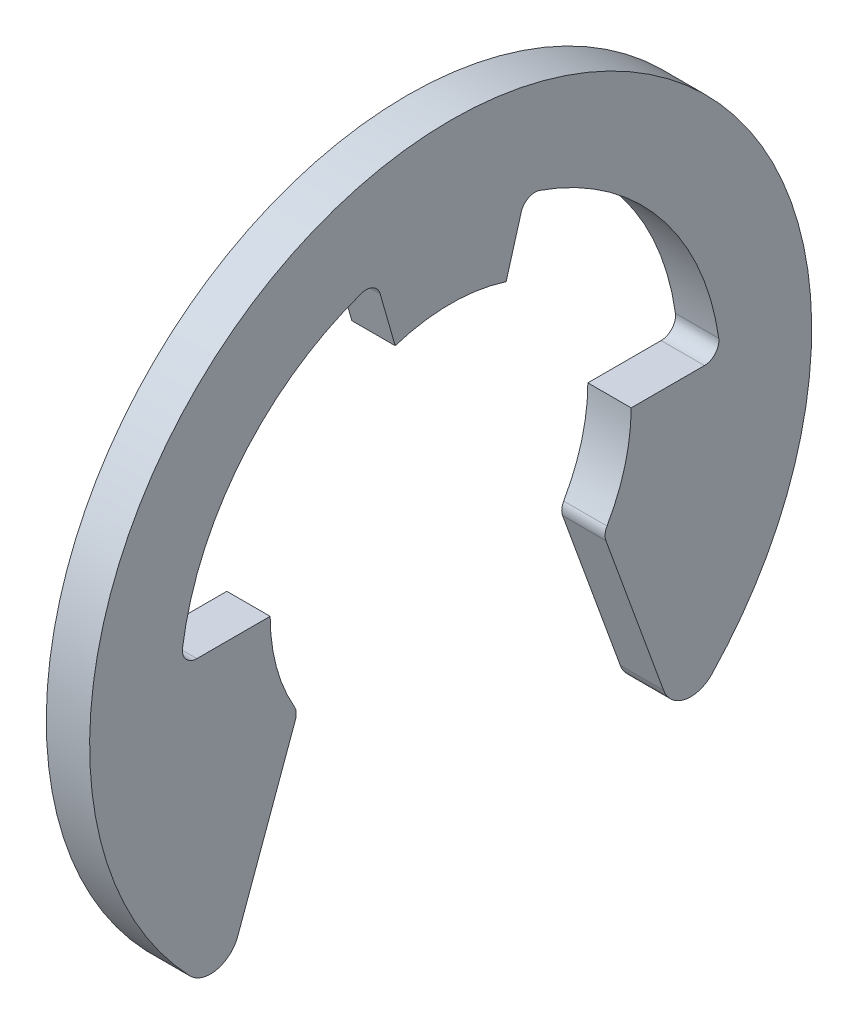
from build123d import *

# Parameters (mm, degrees)
BASE_EXTRUSION_DEPTH = 1.2


with BuildPart() as part:
    # Esquisse1 → Base-Extrusion (new body)
    with BuildSketch(Plane(origin=(0, 0, 0), x_dir=(0, 0, -1), z_dir=(1, 0, 0))):
        with BuildLine():
            Line((1.536408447, 5.358093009), (1.953916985, 6.814118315))
            ThreePointArc((1.953916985, 6.814118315), (2.154433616, 7.059037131), (2.470163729, 7.081545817))
            ThreePointArc((2.470163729, 7.081545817), (5.792712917, 4.763872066), (7.425237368, 1.056338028))
            ThreePointArc((7.425237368, 1.056338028), (7.331329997, 0.737831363), (7.029224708, 0.6))
            Line((7.029224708, 0.6), (5, 0.6))
            ThreePointArc((5, 0.6), (4.829638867, -0.694058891), (4.330164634, -1.899934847))
            ThreePointArc((4.330164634, -1.899934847), (4.278099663, -2.065070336), (4.300700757, -2.236737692))
            Line((4.300700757, -2.236737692), (5.89959949, -6.629675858))
            ThreePointArc((5.89959949, -6.629675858), (6.487076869, -7.139011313), (7.229732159, -6.908760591))
            ThreePointArc((7.229732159, -6.908760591), (0, 10), (-7.229732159, -6.908760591))
            ThreePointArc((-7.229732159, -6.908760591), (-6.487076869, -7.139011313), (-5.89959949, -6.629675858))
            Line((-5.89959949, -6.629675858), (-4.300700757, -2.236737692))
            ThreePointArc((-4.300700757, -2.236737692), (-4.278099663, -2.065070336), (-4.330164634, -1.899934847))
            ThreePointArc((-4.330164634, -1.899934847), (-4.829638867, -0.694058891), (-5, 0.6))
            Line((-5, 0.6), (-7.029224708, 0.6))
            ThreePointArc((-7.029224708, 0.6), (-7.331329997, 0.737831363), (-7.425237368, 1.056338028))
            ThreePointArc((-7.425237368, 1.056338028), (-5.792712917, 4.763872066), (-2.470163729, 7.081545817))
            ThreePointArc((-2.470163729, 7.081545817), (-2.154433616, 7.059037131), (-1.953916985, 6.814118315))
            Line((-1.953916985, 6.814118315), (-1.536408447, 5.358093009))
            ThreePointArc((-1.536408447, 5.358093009), (0, 5.6), (1.536408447, 5.358093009))
        make_face()
    extrude(amount=BASE_EXTRUSION_DEPTH)


solid = part.part
